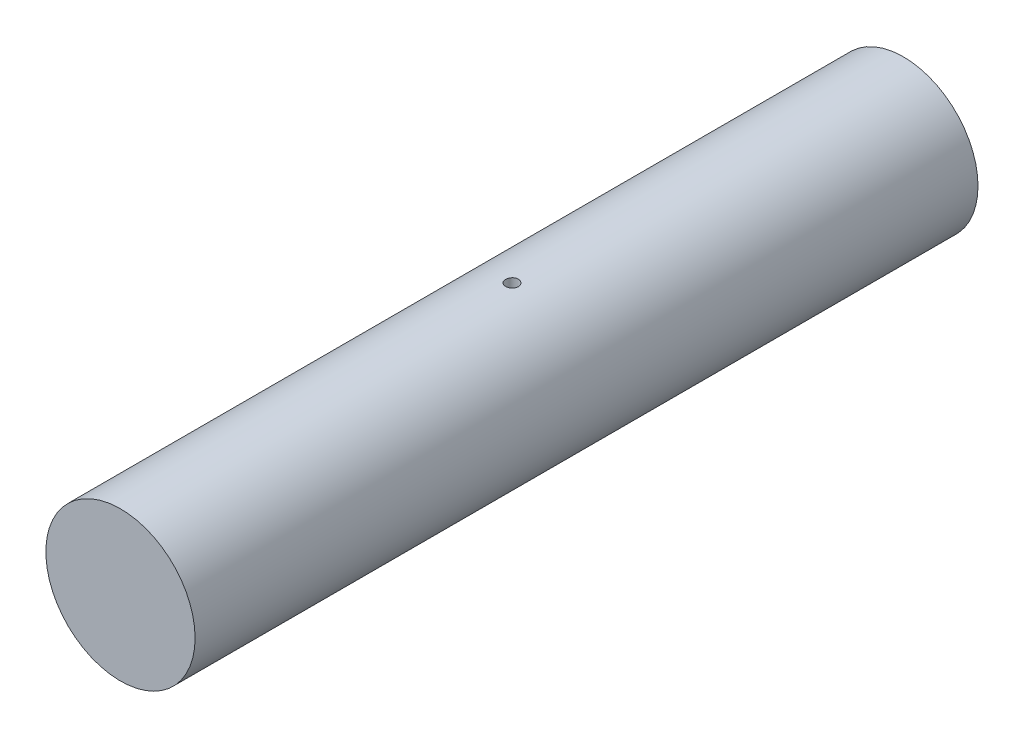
ISO-10303-21;
HEADER;
FILE_DESCRIPTION(('STEP AP214'),'2;1');
FILE_NAME('part.step','',(''),(''),'','','');
FILE_SCHEMA(('AUTOMOTIVE_DESIGN { 1 0 10303 214 1 1 1 1 }'));
ENDSEC;
DATA;
#1=APPLICATION_CONTEXT('core data for automotive mechanical design processes');
#2=APPLICATION_PROTOCOL_DEFINITION('international standard','automotive_design',2000,#1);
#3=PRODUCT_CONTEXT('',#1,'mechanical');
#4=PRODUCT('Part','Part','',(#3));
#5=PRODUCT_RELATED_PRODUCT_CATEGORY('part','',(#4));
#6=PRODUCT_DEFINITION_FORMATION('','',#4);
#7=PRODUCT_DEFINITION_CONTEXT('part definition',#1,'design');
#8=PRODUCT_DEFINITION('design','',#6,#7);
#9=PRODUCT_DEFINITION_SHAPE('','',#8);
#10=(LENGTH_UNIT() NAMED_UNIT(*) SI_UNIT(.MILLI.,.METRE.));
#11=(NAMED_UNIT(*) PLANE_ANGLE_UNIT() SI_UNIT($,.RADIAN.));
#12=(NAMED_UNIT(*) SI_UNIT($,.STERADIAN.) SOLID_ANGLE_UNIT());
#13=UNCERTAINTY_MEASURE_WITH_UNIT(LENGTH_MEASURE(1.E-05),#10,'distance_accuracy_value','');
#14=(GEOMETRIC_REPRESENTATION_CONTEXT(3) GLOBAL_UNCERTAINTY_ASSIGNED_CONTEXT((#13)) GLOBAL_UNIT_ASSIGNED_CONTEXT((#10,
#11,#12)) REPRESENTATION_CONTEXT('',''));
#15=CARTESIAN_POINT('',(0.,0.,0.));
#16=DIRECTION('',(0.,0.,1.));
#17=DIRECTION('',(1.,0.,0.));
#18=AXIS2_PLACEMENT_3D('',#15,#16,#17);
#19=CARTESIAN_POINT('',(0.,0.,406.4));
#20=DIRECTION('',(0.,0.,-1.));
#21=DIRECTION('',(-1.,0.,0.));
#22=AXIS2_PLACEMENT_3D('',#19,#20,#21);
#23=CYLINDRICAL_SURFACE('',#22,77.47);
#24=CARTESIAN_POINT('',(0.,-77.47,6.604));
#25=CARTESIAN_POINT('',(0.185180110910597,-77.4700003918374,6.60400168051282));
#26=CARTESIAN_POINT('',(0.370334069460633,-77.4693346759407,6.59620814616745));
#27=CARTESIAN_POINT('',(0.739382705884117,-77.466691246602,6.56509090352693));
#28=CARTESIAN_POINT('',(0.923277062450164,-77.4647132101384,6.54176337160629));
#29=CARTESIAN_POINT('',(1.28858442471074,-77.4594981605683,6.47971629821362));
#30=CARTESIAN_POINT('',(1.46999526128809,-77.4562601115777,6.44098409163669));
#31=CARTESIAN_POINT('',(1.82896095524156,-77.4486154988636,6.34839243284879));
#32=CARTESIAN_POINT('',(2.00651437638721,-77.4442085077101,6.29452744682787));
#33=CARTESIAN_POINT('',(2.35627053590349,-77.4343558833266,6.17212293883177));
#34=CARTESIAN_POINT('',(2.52847815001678,-77.4289112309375,6.10359726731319));
#35=CARTESIAN_POINT('',(2.86656432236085,-77.4171320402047,5.95230505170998));
#36=CARTESIAN_POINT('',(3.03244052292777,-77.4107971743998,5.86953326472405));
#37=CARTESIAN_POINT('',(3.35653358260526,-77.3974216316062,5.69040937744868));
#38=CARTESIAN_POINT('',(3.51475486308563,-77.3903813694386,5.59406524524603));
#39=CARTESIAN_POINT('',(3.82258880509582,-77.3757873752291,5.38840496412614));
#40=CARTESIAN_POINT('',(3.97219825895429,-77.3682334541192,5.27908402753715));
#41=CARTESIAN_POINT('',(4.26198489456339,-77.3528117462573,5.04804006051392));
#42=CARTESIAN_POINT('',(4.40214269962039,-77.3449433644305,4.92629276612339));
#43=CARTESIAN_POINT('',(4.67176235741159,-77.3291263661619,4.67138981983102));
#44=CARTESIAN_POINT('',(4.80122023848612,-77.3211777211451,4.53822996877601));
#45=CARTESIAN_POINT('',(5.04842940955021,-77.3054306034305,4.26152376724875));
#46=CARTESIAN_POINT('',(5.16618448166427,-77.2976320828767,4.11798079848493));
#47=CARTESIAN_POINT('',(5.38924477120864,-77.2824006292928,3.82142580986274));
#48=CARTESIAN_POINT('',(5.49454537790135,-77.2749678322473,3.668410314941));
#49=CARTESIAN_POINT('',(5.69201332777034,-77.2606737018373,3.35385202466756));
#50=CARTESIAN_POINT('',(5.78416526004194,-77.253813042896,3.19229952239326));
#51=CARTESIAN_POINT('',(5.95456214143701,-77.2408660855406,2.8619174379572));
#52=CARTESIAN_POINT('',(6.03280193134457,-77.2347800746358,2.69308518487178));
#53=CARTESIAN_POINT('',(6.17474226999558,-77.2235620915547,2.34944677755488));
#54=CARTESIAN_POINT('',(6.23844839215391,-77.2184297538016,2.17464294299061));
#55=CARTESIAN_POINT('',(6.35091739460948,-77.2092603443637,1.82024543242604));
#56=CARTESIAN_POINT('',(6.39967476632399,-77.2052236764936,1.64065001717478));
#57=CARTESIAN_POINT('',(6.5226724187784,-77.1949661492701,1.09760581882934));
#58=CARTESIAN_POINT('',(6.57414360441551,-77.1905564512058,0.728671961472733));
#59=CARTESIAN_POINT('',(6.61442152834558,-77.1871146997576,-0.0124221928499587));
#60=CARTESIAN_POINT('',(6.60322949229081,-77.1880825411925,-0.384582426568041));
#61=CARTESIAN_POINT('',(6.51870433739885,-77.1952664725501,-1.12078063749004));
#62=CARTESIAN_POINT('',(6.4455344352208,-77.2014687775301,-1.48483737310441));
#63=CARTESIAN_POINT('',(6.23936238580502,-77.218403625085,-2.19546922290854));
#64=CARTESIAN_POINT('',(6.10635963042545,-77.2291362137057,-2.54204415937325));
#65=CARTESIAN_POINT('',(5.784120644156,-77.2539375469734,-3.20841174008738));
#66=CARTESIAN_POINT('',(5.59481125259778,-77.2680106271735,-3.52816884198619));
#67=CARTESIAN_POINT('',(5.16538395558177,-77.2979034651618,-4.13143056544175));
#68=CARTESIAN_POINT('',(4.92526497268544,-77.3137232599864,-4.41493441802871));
#69=CARTESIAN_POINT('',(4.40011972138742,-77.3453883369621,-4.93859249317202));
#70=CARTESIAN_POINT('',(4.11495232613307,-77.3612335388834,-5.17860521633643));
#71=CARTESIAN_POINT('',(3.50829710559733,-77.3911159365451,-5.60737327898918));
#72=CARTESIAN_POINT('',(3.18680925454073,-77.4051531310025,-5.79612858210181));
#73=CARTESIAN_POINT('',(2.51654640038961,-77.4298407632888,-6.11701534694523));
#74=CARTESIAN_POINT('',(2.16776833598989,-77.4404908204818,-6.24914044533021));
#75=CARTESIAN_POINT('',(1.4528682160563,-77.4571999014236,-6.4529166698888));
#76=CARTESIAN_POINT('',(1.0867465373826,-77.4632590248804,-6.52456910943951));
#77=CARTESIAN_POINT('',(0.348778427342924,-77.4700907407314,-6.60518844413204));
#78=CARTESIAN_POINT('',(-0.0230465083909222,-77.4708798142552,-6.61435076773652));
#79=CARTESIAN_POINT('',(-0.76294389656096,-77.4671265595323,-6.57024187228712));
#80=CARTESIAN_POINT('',(-1.13101638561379,-77.4625842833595,-6.51697126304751));
#81=CARTESIAN_POINT('',(-1.85240269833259,-77.4486897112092,-6.34967067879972));
#82=CARTESIAN_POINT('',(-2.20573770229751,-77.439344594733,-6.23573138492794));
#83=CARTESIAN_POINT('',(-2.88827547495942,-77.4168939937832,-5.95042033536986));
#84=CARTESIAN_POINT('',(-3.21747784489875,-77.4037884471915,-5.77904763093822));
#85=CARTESIAN_POINT('',(-3.84329428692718,-77.3752446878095,-5.38324432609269));
#86=CARTESIAN_POINT('',(-4.13982628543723,-77.3598008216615,-5.15868437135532));
#87=CARTESIAN_POINT('',(-4.69105566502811,-77.3283342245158,-4.66306638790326));
#88=CARTESIAN_POINT('',(-4.94575228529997,-77.3123114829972,-4.3920075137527));
#89=CARTESIAN_POINT('',(-5.40675273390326,-77.2814440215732,-3.81024246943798));
#90=CARTESIAN_POINT('',(-5.61292895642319,-77.2666024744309,-3.49943500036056));
#91=CARTESIAN_POINT('',(-5.97015891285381,-77.2398235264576,-2.84748073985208));
#92=CARTESIAN_POINT('',(-6.12121321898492,-77.2278860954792,-2.50633426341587));
#93=CARTESIAN_POINT('',(-6.36370163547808,-77.2082835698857,-1.8039052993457));
#94=CARTESIAN_POINT('',(-6.45521362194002,-77.2006128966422,-1.44264978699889));
#95=CARTESIAN_POINT('',(-6.57624657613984,-77.1903992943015,-0.709630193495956));
#96=CARTESIAN_POINT('',(-6.60576879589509,-77.1878562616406,-0.33786632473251));
#97=CARTESIAN_POINT('',(-6.60299122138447,-77.1880897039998,0.218570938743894));
#98=CARTESIAN_POINT('',(-6.59425613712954,-77.1888392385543,0.403652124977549));
#99=CARTESIAN_POINT('',(-6.56128134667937,-77.1916499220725,0.772399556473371));
#100=CARTESIAN_POINT('',(-6.53704738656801,-77.1937105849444,0.956066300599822));
#101=CARTESIAN_POINT('',(-6.47323184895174,-77.1990879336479,1.32075126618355));
#102=CARTESIAN_POINT('',(-6.43364462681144,-77.2024050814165,1.50176848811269));
#103=CARTESIAN_POINT('',(-6.33943023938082,-77.2101985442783,1.85975236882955));
#104=CARTESIAN_POINT('',(-6.28480858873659,-77.2146744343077,2.03672048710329));
#105=CARTESIAN_POINT('',(-6.16089293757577,-77.2246603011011,2.38547099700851));
#106=CARTESIAN_POINT('',(-6.09159458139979,-77.2301705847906,2.55725183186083));
#107=CARTESIAN_POINT('',(-5.93885983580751,-77.242065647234,2.89430120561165));
#108=CARTESIAN_POINT('',(-5.85542862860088,-77.2484501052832,3.05957210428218));
#109=CARTESIAN_POINT('',(-5.67497260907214,-77.2619166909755,3.38256351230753));
#110=CARTESIAN_POINT('',(-5.57794307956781,-77.2689990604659,3.54028137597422));
#111=CARTESIAN_POINT('',(-5.37103722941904,-77.2836567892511,3.84694369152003));
#112=CARTESIAN_POINT('',(-5.26116560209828,-77.2912319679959,3.99589131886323));
#113=CARTESIAN_POINT('',(-5.02892250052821,-77.3066906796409,4.28452843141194));
#114=CARTESIAN_POINT('',(-4.90650945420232,-77.3145751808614,4.42418441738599));
#115=CARTESIAN_POINT('',(-4.65040975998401,-77.3304017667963,4.69264393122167));
#116=CARTESIAN_POINT('',(-4.51672725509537,-77.3383438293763,4.82145141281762));
#117=CARTESIAN_POINT('',(-4.23890599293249,-77.354068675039,5.06743884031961));
#118=CARTESIAN_POINT('',(-4.09476089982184,-77.3618513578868,5.18461163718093));
#119=CARTESIAN_POINT('',(-3.7971572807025,-77.3770294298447,5.40636997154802));
#120=CARTESIAN_POINT('',(-3.64370221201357,-77.3844249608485,5.51096013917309));
#121=CARTESIAN_POINT('',(-3.32814746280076,-77.3986390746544,5.70708676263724));
#122=CARTESIAN_POINT('',(-3.16602867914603,-77.4054562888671,5.79859258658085));
#123=CARTESIAN_POINT('',(-2.83468347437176,-77.4182985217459,5.96757576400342));
#124=CARTESIAN_POINT('',(-2.66545968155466,-77.4243238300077,6.04505824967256));
#125=CARTESIAN_POINT('',(-2.32119162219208,-77.4354091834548,6.18541896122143));
#126=CARTESIAN_POINT('',(-2.14615237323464,-77.4404700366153,6.24830942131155));
#127=CARTESIAN_POINT('',(-1.79142644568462,-77.4494879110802,6.35909860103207));
#128=CARTESIAN_POINT('',(-1.61174094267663,-77.4534452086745,6.40700107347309));
#129=CARTESIAN_POINT('',(-1.19578447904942,-77.4611254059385,6.49927693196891));
#130=CARTESIAN_POINT('',(-0.958347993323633,-77.4644405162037,6.53851157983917));
#131=CARTESIAN_POINT('',(-0.480592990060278,-77.4688775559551,6.59087198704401));
#132=CARTESIAN_POINT('',(-0.240274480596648,-77.469999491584,6.60399781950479));
#133=CARTESIAN_POINT('',(0.,-77.47,6.604));
#134=B_SPLINE_CURVE_WITH_KNOTS('',3,(#24,#25,#26,#27,#28,#29,#30,#31,#32,#33,#34,#35,#36,#37,
#38,#39,#40,#41,#42,#43,#44,#45,#46,#47,#48,#49,#50,#51,#52,#53,#54,#55,#56,#57,#58,#59,#60,#61,
#62,#63,#64,#65,#66,#67,#68,#69,#70,#71,#72,#73,#74,#75,#76,#77,#78,#79,#80,#81,#82,#83,#84,#85,
#86,#87,#88,#89,#90,#91,#92,#93,#94,#95,#96,#97,#98,#99,#100,#101,#102,#103,#104,#105,#106,#107,
#108,#109,#110,#111,#112,#113,#114,#115,#116,#117,#118,#119,#120,#121,#122,#123,#124,#125,#126,
#127,#128,#129,#130,#131,#132,#133),.UNSPECIFIED.,.T.,.F.,(4,2,2,2,2,2,2,2,2,2,2,2,2,2,2,2,2,2,
2,2,2,2,2,2,2,2,2,2,2,2,2,2,2,2,2,2,2,2,2,2,2,2,2,2,2,2,2,2,2,2,2,2,2,2,4),(0.,
0.555330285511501,1.11079731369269,1.66672197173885,2.22285018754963,2.77845531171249,
3.33426535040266,3.88975043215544,4.44544109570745,5.00223835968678,5.55924137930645,
6.1160637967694,6.67309171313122,7.23076722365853,7.78864911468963,8.34631670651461,
8.90418955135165,10.0160024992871,11.1277937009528,12.2366661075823,13.3455497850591,
14.4558806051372,15.5662349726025,16.680139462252,17.7940447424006,18.9080751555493,
20.022081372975,21.1326020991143,22.2431119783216,23.3519666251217,24.4608395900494,
25.5724376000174,26.6840558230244,27.7985656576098,28.9130639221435,30.026101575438,
31.1391167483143,31.69444269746,32.2495628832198,32.8048873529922,33.3600083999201,
33.9152944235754,34.4703772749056,35.0256531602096,35.5807267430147,36.1377037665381,
36.6944769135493,37.2515900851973,37.8084976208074,38.366688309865,38.924674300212,
39.4821907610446,40.0395675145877,40.7601204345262,41.4806713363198),.UNSPECIFIED.);
#135=CARTESIAN_POINT('',(0.,-77.47,6.604));
#136=VERTEX_POINT('',#135);
#137=EDGE_CURVE('E10',#136,#136,#134,.T.);
#138=ORIENTED_EDGE('',*,*,#137,.T.);
#139=EDGE_LOOP('',(#138));
#140=FACE_BOUND('',#139,.T.);
#141=CARTESIAN_POINT('',(0.,77.47,6.604));
#142=CARTESIAN_POINT('',(-0.185180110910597,77.4700003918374,6.60400168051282));
#143=CARTESIAN_POINT('',(-0.370334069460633,77.4693346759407,6.59620814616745));
#144=CARTESIAN_POINT('',(-0.739382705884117,77.466691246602,6.56509090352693));
#145=CARTESIAN_POINT('',(-0.923277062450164,77.4647132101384,6.54176337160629));
#146=CARTESIAN_POINT('',(-1.28858442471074,77.4594981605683,6.47971629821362));
#147=CARTESIAN_POINT('',(-1.46999526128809,77.4562601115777,6.44098409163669));
#148=CARTESIAN_POINT('',(-1.82896095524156,77.4486154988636,6.34839243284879));
#149=CARTESIAN_POINT('',(-2.00651437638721,77.4442085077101,6.29452744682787));
#150=CARTESIAN_POINT('',(-2.35627053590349,77.4343558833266,6.17212293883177));
#151=CARTESIAN_POINT('',(-2.52847815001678,77.4289112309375,6.10359726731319));
#152=CARTESIAN_POINT('',(-2.86656432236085,77.4171320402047,5.95230505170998));
#153=CARTESIAN_POINT('',(-3.03244052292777,77.4107971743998,5.86953326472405));
#154=CARTESIAN_POINT('',(-3.35653358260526,77.3974216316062,5.69040937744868));
#155=CARTESIAN_POINT('',(-3.51475486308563,77.3903813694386,5.59406524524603));
#156=CARTESIAN_POINT('',(-3.82258880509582,77.3757873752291,5.38840496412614));
#157=CARTESIAN_POINT('',(-3.97219825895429,77.3682334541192,5.27908402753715));
#158=CARTESIAN_POINT('',(-4.26198489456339,77.3528117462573,5.04804006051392));
#159=CARTESIAN_POINT('',(-4.40214269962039,77.3449433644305,4.92629276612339));
#160=CARTESIAN_POINT('',(-4.67176235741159,77.3291263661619,4.67138981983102));
#161=CARTESIAN_POINT('',(-4.80122023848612,77.3211777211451,4.53822996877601));
#162=CARTESIAN_POINT('',(-5.04842940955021,77.3054306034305,4.26152376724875));
#163=CARTESIAN_POINT('',(-5.16618448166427,77.2976320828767,4.11798079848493));
#164=CARTESIAN_POINT('',(-5.38924477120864,77.2824006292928,3.82142580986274));
#165=CARTESIAN_POINT('',(-5.49454537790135,77.2749678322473,3.668410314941));
#166=CARTESIAN_POINT('',(-5.69201332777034,77.2606737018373,3.35385202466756));
#167=CARTESIAN_POINT('',(-5.78416526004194,77.253813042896,3.19229952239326));
#168=CARTESIAN_POINT('',(-5.95456214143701,77.2408660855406,2.8619174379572));
#169=CARTESIAN_POINT('',(-6.03280193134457,77.2347800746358,2.69308518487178));
#170=CARTESIAN_POINT('',(-6.17474226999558,77.2235620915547,2.34944677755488));
#171=CARTESIAN_POINT('',(-6.23844839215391,77.2184297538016,2.17464294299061));
#172=CARTESIAN_POINT('',(-6.35091739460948,77.2092603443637,1.82024543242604));
#173=CARTESIAN_POINT('',(-6.39967476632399,77.2052236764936,1.64065001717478));
#174=CARTESIAN_POINT('',(-6.5226724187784,77.1949661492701,1.09760581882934));
#175=CARTESIAN_POINT('',(-6.57414360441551,77.1905564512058,0.728671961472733));
#176=CARTESIAN_POINT('',(-6.61442152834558,77.1871146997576,-0.0124221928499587));
#177=CARTESIAN_POINT('',(-6.60322949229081,77.1880825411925,-0.384582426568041));
#178=CARTESIAN_POINT('',(-6.51870433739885,77.1952664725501,-1.12078063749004));
#179=CARTESIAN_POINT('',(-6.4455344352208,77.2014687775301,-1.48483737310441));
#180=CARTESIAN_POINT('',(-6.23936238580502,77.218403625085,-2.19546922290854));
#181=CARTESIAN_POINT('',(-6.10635963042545,77.2291362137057,-2.54204415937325));
#182=CARTESIAN_POINT('',(-5.784120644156,77.2539375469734,-3.20841174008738));
#183=CARTESIAN_POINT('',(-5.59481125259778,77.2680106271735,-3.52816884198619));
#184=CARTESIAN_POINT('',(-5.16538395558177,77.2979034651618,-4.13143056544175));
#185=CARTESIAN_POINT('',(-4.92526497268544,77.3137232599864,-4.41493441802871));
#186=CARTESIAN_POINT('',(-4.40011972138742,77.3453883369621,-4.93859249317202));
#187=CARTESIAN_POINT('',(-4.11495232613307,77.3612335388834,-5.17860521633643));
#188=CARTESIAN_POINT('',(-3.50829710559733,77.3911159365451,-5.60737327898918));
#189=CARTESIAN_POINT('',(-3.18680925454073,77.4051531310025,-5.79612858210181));
#190=CARTESIAN_POINT('',(-2.51654640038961,77.4298407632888,-6.11701534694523));
#191=CARTESIAN_POINT('',(-2.16776833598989,77.4404908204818,-6.24914044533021));
#192=CARTESIAN_POINT('',(-1.4528682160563,77.4571999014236,-6.4529166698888));
#193=CARTESIAN_POINT('',(-1.0867465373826,77.4632590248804,-6.52456910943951));
#194=CARTESIAN_POINT('',(-0.348778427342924,77.4700907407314,-6.60518844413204));
#195=CARTESIAN_POINT('',(0.0230465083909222,77.4708798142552,-6.61435076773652));
#196=CARTESIAN_POINT('',(0.76294389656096,77.4671265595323,-6.57024187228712));
#197=CARTESIAN_POINT('',(1.13101638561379,77.4625842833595,-6.51697126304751));
#198=CARTESIAN_POINT('',(1.85240269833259,77.4486897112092,-6.34967067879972));
#199=CARTESIAN_POINT('',(2.20573770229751,77.439344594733,-6.23573138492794));
#200=CARTESIAN_POINT('',(2.88827547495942,77.4168939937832,-5.95042033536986));
#201=CARTESIAN_POINT('',(3.21747784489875,77.4037884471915,-5.77904763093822));
#202=CARTESIAN_POINT('',(3.84329428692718,77.3752446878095,-5.38324432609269));
#203=CARTESIAN_POINT('',(4.13982628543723,77.3598008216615,-5.15868437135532));
#204=CARTESIAN_POINT('',(4.69105566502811,77.3283342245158,-4.66306638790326));
#205=CARTESIAN_POINT('',(4.94575228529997,77.3123114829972,-4.3920075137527));
#206=CARTESIAN_POINT('',(5.40675273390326,77.2814440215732,-3.81024246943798));
#207=CARTESIAN_POINT('',(5.61292895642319,77.2666024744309,-3.49943500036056));
#208=CARTESIAN_POINT('',(5.97015891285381,77.2398235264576,-2.84748073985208));
#209=CARTESIAN_POINT('',(6.12121321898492,77.2278860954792,-2.50633426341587));
#210=CARTESIAN_POINT('',(6.36370163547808,77.2082835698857,-1.8039052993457));
#211=CARTESIAN_POINT('',(6.45521362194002,77.2006128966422,-1.44264978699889));
#212=CARTESIAN_POINT('',(6.57624657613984,77.1903992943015,-0.709630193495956));
#213=CARTESIAN_POINT('',(6.60576879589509,77.1878562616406,-0.33786632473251));
#214=CARTESIAN_POINT('',(6.60299122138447,77.1880897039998,0.218570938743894));
#215=CARTESIAN_POINT('',(6.59425613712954,77.1888392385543,0.403652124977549));
#216=CARTESIAN_POINT('',(6.56128134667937,77.1916499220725,0.772399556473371));
#217=CARTESIAN_POINT('',(6.53704738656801,77.1937105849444,0.956066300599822));
#218=CARTESIAN_POINT('',(6.47323184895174,77.1990879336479,1.32075126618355));
#219=CARTESIAN_POINT('',(6.43364462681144,77.2024050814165,1.50176848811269));
#220=CARTESIAN_POINT('',(6.33943023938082,77.2101985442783,1.85975236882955));
#221=CARTESIAN_POINT('',(6.28480858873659,77.2146744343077,2.03672048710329));
#222=CARTESIAN_POINT('',(6.16089293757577,77.2246603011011,2.38547099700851));
#223=CARTESIAN_POINT('',(6.09159458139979,77.2301705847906,2.55725183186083));
#224=CARTESIAN_POINT('',(5.93885983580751,77.242065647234,2.89430120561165));
#225=CARTESIAN_POINT('',(5.85542862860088,77.2484501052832,3.05957210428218));
#226=CARTESIAN_POINT('',(5.67497260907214,77.2619166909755,3.38256351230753));
#227=CARTESIAN_POINT('',(5.57794307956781,77.2689990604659,3.54028137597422));
#228=CARTESIAN_POINT('',(5.37103722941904,77.2836567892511,3.84694369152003));
#229=CARTESIAN_POINT('',(5.26116560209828,77.2912319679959,3.99589131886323));
#230=CARTESIAN_POINT('',(5.02892250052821,77.3066906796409,4.28452843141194));
#231=CARTESIAN_POINT('',(4.90650945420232,77.3145751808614,4.42418441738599));
#232=CARTESIAN_POINT('',(4.65040975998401,77.3304017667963,4.69264393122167));
#233=CARTESIAN_POINT('',(4.51672725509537,77.3383438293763,4.82145141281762));
#234=CARTESIAN_POINT('',(4.23890599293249,77.354068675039,5.06743884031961));
#235=CARTESIAN_POINT('',(4.09476089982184,77.3618513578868,5.18461163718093));
#236=CARTESIAN_POINT('',(3.7971572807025,77.3770294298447,5.40636997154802));
#237=CARTESIAN_POINT('',(3.64370221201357,77.3844249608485,5.51096013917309));
#238=CARTESIAN_POINT('',(3.32814746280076,77.3986390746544,5.70708676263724));
#239=CARTESIAN_POINT('',(3.16602867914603,77.4054562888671,5.79859258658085));
#240=CARTESIAN_POINT('',(2.83468347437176,77.4182985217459,5.96757576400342));
#241=CARTESIAN_POINT('',(2.66545968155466,77.4243238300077,6.04505824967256));
#242=CARTESIAN_POINT('',(2.32119162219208,77.4354091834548,6.18541896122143));
#243=CARTESIAN_POINT('',(2.14615237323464,77.4404700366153,6.24830942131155));
#244=CARTESIAN_POINT('',(1.79142644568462,77.4494879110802,6.35909860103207));
#245=CARTESIAN_POINT('',(1.61174094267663,77.4534452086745,6.40700107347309));
#246=CARTESIAN_POINT('',(1.19578447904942,77.4611254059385,6.49927693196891));
#247=CARTESIAN_POINT('',(0.958347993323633,77.4644405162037,6.53851157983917));
#248=CARTESIAN_POINT('',(0.480592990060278,77.4688775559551,6.59087198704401));
#249=CARTESIAN_POINT('',(0.240274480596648,77.469999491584,6.60399781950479));
#250=CARTESIAN_POINT('',(0.,77.47,6.604));
#251=B_SPLINE_CURVE_WITH_KNOTS('',3,(#141,#142,#143,#144,#145,#146,#147,#148,#149,#150,#151,
#152,#153,#154,#155,#156,#157,#158,#159,#160,#161,#162,#163,#164,#165,#166,#167,#168,#169,#170,
#171,#172,#173,#174,#175,#176,#177,#178,#179,#180,#181,#182,#183,#184,#185,#186,#187,#188,#189,
#190,#191,#192,#193,#194,#195,#196,#197,#198,#199,#200,#201,#202,#203,#204,#205,#206,#207,#208,
#209,#210,#211,#212,#213,#214,#215,#216,#217,#218,#219,#220,#221,#222,#223,#224,#225,#226,#227,
#228,#229,#230,#231,#232,#233,#234,#235,#236,#237,#238,#239,#240,#241,#242,#243,#244,#245,#246,
#247,#248,#249,#250),.UNSPECIFIED.,.T.,.F.,(4,2,2,2,2,2,2,2,2,2,2,2,2,2,2,2,2,2,2,2,2,2,2,2,2,2,
2,2,2,2,2,2,2,2,2,2,2,2,2,2,2,2,2,2,2,2,2,2,2,2,2,2,2,2,4),(0.,0.555330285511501,
1.11079731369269,1.66672197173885,2.22285018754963,2.77845531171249,3.33426535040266,
3.88975043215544,4.44544109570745,5.00223835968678,5.55924137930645,6.1160637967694,
6.67309171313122,7.23076722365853,7.78864911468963,8.34631670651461,8.90418955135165,
10.0160024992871,11.1277937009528,12.2366661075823,13.3455497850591,14.4558806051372,
15.5662349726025,16.680139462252,17.7940447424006,18.9080751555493,20.022081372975,
21.1326020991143,22.2431119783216,23.3519666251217,24.4608395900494,25.5724376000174,
26.6840558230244,27.7985656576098,28.9130639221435,30.026101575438,31.1391167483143,
31.69444269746,32.2495628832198,32.8048873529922,33.3600083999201,33.9152944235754,
34.4703772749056,35.0256531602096,35.5807267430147,36.1377037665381,36.6944769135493,
37.2515900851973,37.8084976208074,38.366688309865,38.924674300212,39.4821907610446,
40.0395675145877,40.7601204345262,41.4806713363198),.UNSPECIFIED.);
#252=CARTESIAN_POINT('',(0.,77.47,6.604));
#253=VERTEX_POINT('',#252);
#254=EDGE_CURVE('E46',#253,#253,#251,.T.);
#255=ORIENTED_EDGE('',*,*,#254,.T.);
#256=EDGE_LOOP('',(#255));
#257=FACE_BOUND('',#256,.T.);
#258=CARTESIAN_POINT('',(0.,0.,406.4));
#259=DIRECTION('',(0.,0.,1.));
#260=DIRECTION('',(1.,0.,0.));
#261=AXIS2_PLACEMENT_3D('',#258,#259,#260);
#262=CIRCLE('',#261,77.47);
#263=CARTESIAN_POINT('',(77.47,0.,406.4));
#264=VERTEX_POINT('',#263);
#265=EDGE_CURVE('E50',#264,#264,#262,.T.);
#266=ORIENTED_EDGE('',*,*,#265,.F.);
#267=EDGE_LOOP('',(#266));
#268=FACE_BOUND('',#267,.T.);
#269=CARTESIAN_POINT('',(0.,0.,-406.4));
#270=DIRECTION('',(0.,0.,1.));
#271=DIRECTION('',(1.,0.,0.));
#272=AXIS2_PLACEMENT_3D('',#269,#270,#271);
#273=CIRCLE('',#272,77.47);
#274=CARTESIAN_POINT('',(77.47,0.,-406.4));
#275=VERTEX_POINT('',#274);
#276=EDGE_CURVE('E54',#275,#275,#273,.T.);
#277=ORIENTED_EDGE('',*,*,#276,.T.);
#278=EDGE_LOOP('',(#277));
#279=FACE_BOUND('',#278,.T.);
#280=ADVANCED_FACE('F36',(#140,#257,#268,#279),#23,.T.);
#281=CARTESIAN_POINT('',(0.,0.,406.4));
#282=DIRECTION('',(0.,0.,1.));
#283=DIRECTION('',(1.,0.,0.));
#284=AXIS2_PLACEMENT_3D('',#281,#282,#283);
#285=PLANE('',#284);
#286=ORIENTED_EDGE('',*,*,#265,.T.);
#287=EDGE_LOOP('',(#286));
#288=FACE_BOUND('',#287,.T.);
#289=ADVANCED_FACE('F67',(#288),#285,.T.);
#290=CARTESIAN_POINT('',(0.,0.,-406.4));
#291=DIRECTION('',(0.,0.,1.));
#292=DIRECTION('',(1.,0.,0.));
#293=AXIS2_PLACEMENT_3D('',#290,#291,#292);
#294=PLANE('',#293);
#295=ORIENTED_EDGE('',*,*,#276,.F.);
#296=EDGE_LOOP('',(#295));
#297=FACE_BOUND('',#296,.T.);
#298=ADVANCED_FACE('F63',(#297),#294,.F.);
#299=CARTESIAN_POINT('',(0.,-77.47,0.));
#300=DIRECTION('',(0.,1.,0.));
#301=DIRECTION('',(0.,0.,1.));
#302=AXIS2_PLACEMENT_3D('',#299,#300,#301);
#303=CYLINDRICAL_SURFACE('',#302,6.604);
#304=ORIENTED_EDGE('',*,*,#254,.F.);
#305=EDGE_LOOP('',(#304));
#306=FACE_BOUND('',#305,.T.);
#307=ORIENTED_EDGE('',*,*,#137,.F.);
#308=EDGE_LOOP('',(#307));
#309=FACE_BOUND('',#308,.T.);
#310=ADVANCED_FACE('F59',(#306,#309),#303,.F.);
#311=CLOSED_SHELL('',(#280,#289,#298,#310));
#312=MANIFOLD_SOLID_BREP('B2',#311);
#313=ADVANCED_BREP_SHAPE_REPRESENTATION('',(#18,#312),#14);
#314=SHAPE_DEFINITION_REPRESENTATION(#9,#313);
ENDSEC;
END-ISO-10303-21;
